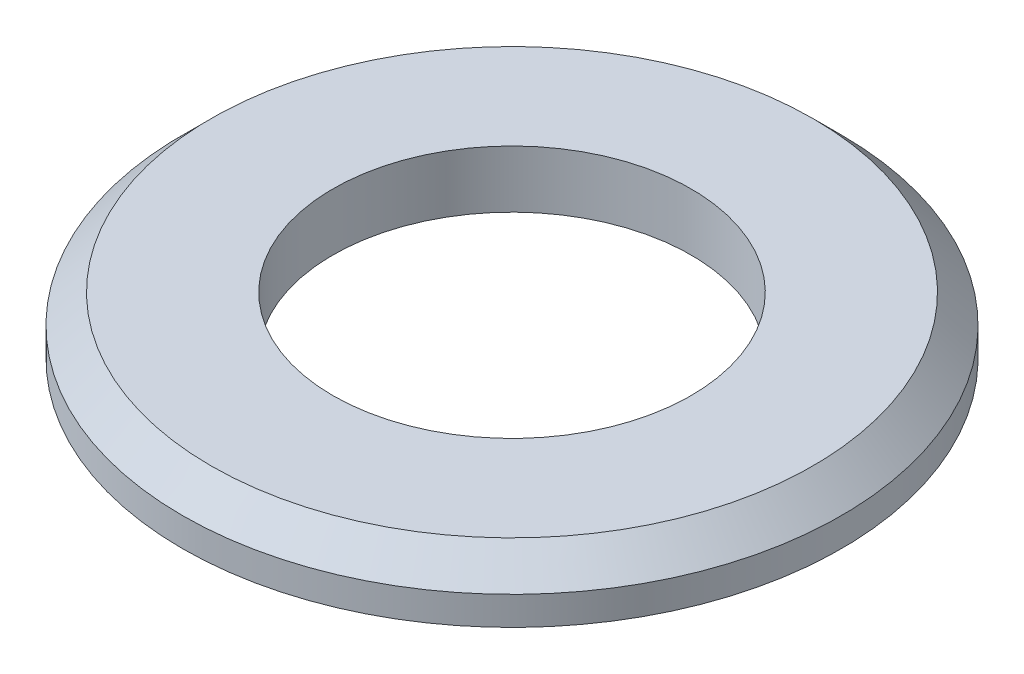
from build123d import *

# Parameters (mm, degrees)
SKETCH1_R      = 46
SKETCH1_R_2    = 25
EXTRUDE1_DEPTH = 8
CHAMFER1_SIZE  = 4


with BuildPart() as part:
    # Sketch1 → Extrude1 (new body)
    with BuildSketch(Plane(origin=(0, 0, 0), x_dir=(1, 0, 0), z_dir=(0, 1, 0))):
        with Locations(Location((0, 0, 0), (0, 0, 270))):
            Circle(SKETCH1_R)
        with Locations(Location((0, 0, 0), (0, 0, 270))):
            Circle(SKETCH1_R_2, mode=Mode.SUBTRACT)
    extrude(amount=EXTRUDE1_DEPTH)

    # Chamfer1
    chamfer1_edges = [part.edges().sort_by_distance(p)[0] for p in [
        (0, 8, -46),
    ]]
    chamfer(chamfer1_edges, length=CHAMFER1_SIZE)


solid = part.part
